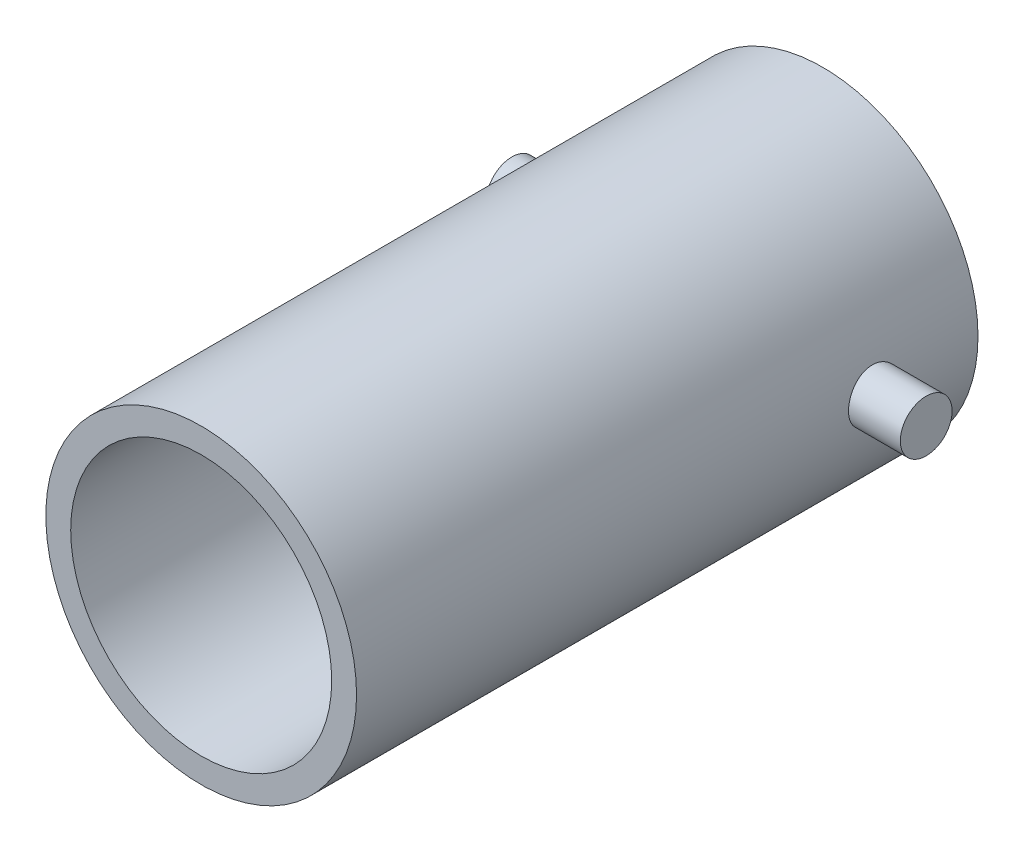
ISO-10303-21;
HEADER;
FILE_DESCRIPTION(('STEP AP214'),'2;1');
FILE_NAME('part.step','',(''),(''),'','','');
FILE_SCHEMA(('AUTOMOTIVE_DESIGN { 1 0 10303 214 1 1 1 1 }'));
ENDSEC;
DATA;
#1=APPLICATION_CONTEXT('core data for automotive mechanical design processes');
#2=APPLICATION_PROTOCOL_DEFINITION('international standard','automotive_design',2000,#1);
#3=PRODUCT_CONTEXT('',#1,'mechanical');
#4=PRODUCT('Part','Part','',(#3));
#5=PRODUCT_RELATED_PRODUCT_CATEGORY('part','',(#4));
#6=PRODUCT_DEFINITION_FORMATION('','',#4);
#7=PRODUCT_DEFINITION_CONTEXT('part definition',#1,'design');
#8=PRODUCT_DEFINITION('design','',#6,#7);
#9=PRODUCT_DEFINITION_SHAPE('','',#8);
#10=(LENGTH_UNIT() NAMED_UNIT(*) SI_UNIT(.MILLI.,.METRE.));
#11=(NAMED_UNIT(*) PLANE_ANGLE_UNIT() SI_UNIT($,.RADIAN.));
#12=(NAMED_UNIT(*) SI_UNIT($,.STERADIAN.) SOLID_ANGLE_UNIT());
#13=UNCERTAINTY_MEASURE_WITH_UNIT(LENGTH_MEASURE(1.E-05),#10,'distance_accuracy_value','');
#14=(GEOMETRIC_REPRESENTATION_CONTEXT(3) GLOBAL_UNCERTAINTY_ASSIGNED_CONTEXT((#13)) GLOBAL_UNIT_ASSIGNED_CONTEXT((#10,
#11,#12)) REPRESENTATION_CONTEXT('',''));
#15=CARTESIAN_POINT('',(0.,0.,0.));
#16=DIRECTION('',(0.,0.,1.));
#17=DIRECTION('',(1.,0.,0.));
#18=AXIS2_PLACEMENT_3D('',#15,#16,#17);
#19=CARTESIAN_POINT('',(0.,15.0876,-57.15));
#20=DIRECTION('',(0.,0.,1.));
#21=DIRECTION('',(1.,0.,0.));
#22=AXIS2_PLACEMENT_3D('',#19,#20,#21);
#23=CYLINDRICAL_SURFACE('',#22,4.7625);
#24=CARTESIAN_POINT('',(-4.7625,15.0876,-59.53125));
#25=CARTESIAN_POINT('',(-4.76249924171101,15.1318566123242,-59.5312517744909));
#26=CARTESIAN_POINT('',(-4.76187667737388,15.1761373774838,-59.5349638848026));
#27=CARTESIAN_POINT('',(-4.7594530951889,15.2634569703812,-59.549708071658));
#28=CARTESIAN_POINT('',(-4.75765099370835,15.3064946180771,-59.5607468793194));
#29=CARTESIAN_POINT('',(-4.75307046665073,15.39005200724,-59.5898019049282));
#30=CARTESIAN_POINT('',(-4.75029283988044,15.4305737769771,-59.6078124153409));
#31=CARTESIAN_POINT('',(-4.74406667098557,15.508015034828,-59.6502846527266));
#32=CARTESIAN_POINT('',(-4.74061820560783,15.5449349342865,-59.6747456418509));
#33=CARTESIAN_POINT('',(-4.73339578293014,15.6144825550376,-59.729673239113));
#34=CARTESIAN_POINT('',(-4.72961929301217,15.6470708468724,-59.760189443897));
#35=CARTESIAN_POINT('',(-4.72218584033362,15.7066895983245,-59.8262544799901));
#36=CARTESIAN_POINT('',(-4.71852888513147,15.7337197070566,-59.8618036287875));
#37=CARTESIAN_POINT('',(-4.7117240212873,15.7816128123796,-59.9371962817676));
#38=CARTESIAN_POINT('',(-4.70857938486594,15.8024368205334,-59.9770648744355));
#39=CARTESIAN_POINT('',(-4.70319033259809,15.8370772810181,-60.0597952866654));
#40=CARTESIAN_POINT('',(-4.70094585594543,15.8508942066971,-60.1026569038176));
#41=CARTESIAN_POINT('',(-4.69763645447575,15.8710040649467,-60.1897387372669));
#42=CARTESIAN_POINT('',(-4.6965608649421,15.8773650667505,-60.2339428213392));
#43=CARTESIAN_POINT('',(-4.69567875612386,15.8825935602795,-60.3228029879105));
#44=CARTESIAN_POINT('',(-4.69587214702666,15.8814615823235,-60.3674590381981));
#45=CARTESIAN_POINT('',(-4.69749641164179,15.8717916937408,-60.455469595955));
#46=CARTESIAN_POINT('',(-4.69891450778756,15.86333025,-60.4988327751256));
#47=CARTESIAN_POINT('',(-4.70280839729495,15.8393616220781,-60.5835152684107));
#48=CARTESIAN_POINT('',(-4.70528422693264,15.8238541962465,-60.6248345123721));
#49=CARTESIAN_POINT('',(-4.71102842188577,15.7861562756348,-60.7044851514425));
#50=CARTESIAN_POINT('',(-4.71430053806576,15.7639340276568,-60.7428012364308));
#51=CARTESIAN_POINT('',(-4.72126601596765,15.7134598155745,-60.8151896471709));
#52=CARTESIAN_POINT('',(-4.72495941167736,15.6852073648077,-60.8492616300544));
#53=CARTESIAN_POINT('',(-4.73240743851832,15.6230581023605,-60.9126372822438));
#54=CARTESIAN_POINT('',(-4.73616226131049,15.5890956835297,-60.9418766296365));
#55=CARTESIAN_POINT('',(-4.7432677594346,15.5167124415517,-60.9942511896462));
#56=CARTESIAN_POINT('',(-4.74661843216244,15.4782915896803,-61.0173863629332));
#57=CARTESIAN_POINT('',(-4.75254285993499,15.3980216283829,-61.0569017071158));
#58=CARTESIAN_POINT('',(-4.75511596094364,15.3561696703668,-61.0732761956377));
#59=CARTESIAN_POINT('',(-4.75919007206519,15.2702572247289,-61.0987456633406));
#60=CARTESIAN_POINT('',(-4.76069117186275,15.2261969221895,-61.1078412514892));
#61=CARTESIAN_POINT('',(-4.76244008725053,15.1376728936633,-61.1184075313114));
#62=CARTESIAN_POINT('',(-4.76270241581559,15.0932199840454,-61.1199665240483));
#63=CARTESIAN_POINT('',(-4.76198398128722,15.0046881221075,-61.1156507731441));
#64=CARTESIAN_POINT('',(-4.76100326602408,14.9606091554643,-61.10977631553));
#65=CARTESIAN_POINT('',(-4.75791792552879,14.8743491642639,-61.090833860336));
#66=CARTESIAN_POINT('',(-4.75582013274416,14.8321582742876,-61.0778095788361));
#67=CARTESIAN_POINT('',(-4.75073492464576,14.7505588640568,-61.0449837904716));
#68=CARTESIAN_POINT('',(-4.74774745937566,14.7111505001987,-61.0251819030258));
#69=CARTESIAN_POINT('',(-4.74117833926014,14.6358512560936,-60.9791607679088));
#70=CARTESIAN_POINT('',(-4.73759166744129,14.5999945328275,-60.9528863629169));
#71=CARTESIAN_POINT('',(-4.73023713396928,14.5331676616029,-60.8947419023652));
#72=CARTESIAN_POINT('',(-4.72646925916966,14.5021978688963,-60.8628714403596));
#73=CARTESIAN_POINT('',(-4.71913005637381,14.4456966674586,-60.7940435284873));
#74=CARTESIAN_POINT('',(-4.71556116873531,14.4202249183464,-60.7570368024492));
#75=CARTESIAN_POINT('',(-4.70906960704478,14.3758595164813,-60.6792179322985));
#76=CARTESIAN_POINT('',(-4.70614691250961,14.3569656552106,-60.6384059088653));
#77=CARTESIAN_POINT('',(-4.70129696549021,14.3263815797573,-60.5543017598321));
#78=CARTESIAN_POINT('',(-4.69936561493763,14.314661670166,-60.5110206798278));
#79=CARTESIAN_POINT('',(-4.69670675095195,14.2986647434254,-60.4230693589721));
#80=CARTESIAN_POINT('',(-4.69597913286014,14.2943870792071,-60.3783992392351));
#81=CARTESIAN_POINT('',(-4.69581462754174,14.29341411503,-60.2895336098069));
#82=CARTESIAN_POINT('',(-4.69636175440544,14.2966249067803,-60.2453391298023));
#83=CARTESIAN_POINT('',(-4.69865005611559,14.3103346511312,-60.1581285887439));
#84=CARTESIAN_POINT('',(-4.70039122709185,14.3208335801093,-60.115112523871));
#85=CARTESIAN_POINT('',(-4.70486535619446,14.3487855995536,-60.0315161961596));
#86=CARTESIAN_POINT('',(-4.70759716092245,14.3662306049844,-59.9909331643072));
#87=CARTESIAN_POINT('',(-4.71374587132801,14.4075699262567,-59.9132546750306));
#88=CARTESIAN_POINT('',(-4.71716281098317,14.4314645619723,-59.8761593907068));
#89=CARTESIAN_POINT('',(-4.72434746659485,14.4853600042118,-59.8060349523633));
#90=CARTESIAN_POINT('',(-4.72811886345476,14.515429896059,-59.7730592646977));
#91=CARTESIAN_POINT('',(-4.73555813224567,14.5806766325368,-59.7125896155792));
#92=CARTESIAN_POINT('',(-4.73922598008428,14.6158546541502,-59.6850969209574));
#93=CARTESIAN_POINT('',(-4.74607423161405,14.6906077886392,-59.6362001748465));
#94=CARTESIAN_POINT('',(-4.74925109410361,14.7302115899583,-59.6148394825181));
#95=CARTESIAN_POINT('',(-4.75472495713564,14.8124821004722,-59.5791069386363));
#96=CARTESIAN_POINT('',(-4.7570228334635,14.8551457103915,-59.5647281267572));
#97=CARTESIAN_POINT('',(-4.75997838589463,14.9295791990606,-59.5464883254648));
#98=CARTESIAN_POINT('',(-4.76091893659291,14.9608988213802,-59.5407831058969));
#99=CARTESIAN_POINT('',(-4.76218001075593,15.0240081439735,-59.5331633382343));
#100=CARTESIAN_POINT('',(-4.76250054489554,15.0557978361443,-59.5312487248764));
#101=CARTESIAN_POINT('',(-4.7625,15.0876,-59.53125));
#102=B_SPLINE_CURVE_WITH_KNOTS('',3,(#24,#25,#26,#27,#28,#29,#30,#31,#32,#33,#34,#35,#36,#37,
#38,#39,#40,#41,#42,#43,#44,#45,#46,#47,#48,#49,#50,#51,#52,#53,#54,#55,#56,#57,#58,#59,#60,#61,
#62,#63,#64,#65,#66,#67,#68,#69,#70,#71,#72,#73,#74,#75,#76,#77,#78,#79,#80,#81,#82,#83,#84,#85,
#86,#87,#88,#89,#90,#91,#92,#93,#94,#95,#96,#97,#98,#99,#100,#101),.UNSPECIFIED.,.T.,.F.,(4,2,2,
2,2,2,2,2,2,2,2,2,2,2,2,2,2,2,2,2,2,2,2,2,2,2,2,2,2,2,2,2,2,2,2,2,2,2,4),(0.,0.132653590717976,
0.265429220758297,0.398096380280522,0.530748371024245,0.664535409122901,0.798330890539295,
0.932950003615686,1.06756002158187,1.20093129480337,1.33429312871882,1.4662801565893,
1.59827171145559,1.73089746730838,1.86353393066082,1.99781404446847,2.13209502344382,
2.266488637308,2.40087100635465,2.53367503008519,2.66647394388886,2.79846978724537,
2.93047304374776,3.0636426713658,3.19682197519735,3.33138088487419,3.46593552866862,
3.59992937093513,3.73391156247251,3.86622261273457,3.99853323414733,4.13069029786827,
4.26285391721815,4.39658564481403,4.53034823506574,4.66503458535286,4.79958638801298,
4.89491098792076,4.99023394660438),.UNSPECIFIED.);
#103=CARTESIAN_POINT('',(-4.7625,15.0876,-59.53125));
#104=VERTEX_POINT('',#103);
#105=EDGE_CURVE('E50',#104,#104,#102,.T.);
#106=ORIENTED_EDGE('',*,*,#105,.F.);
#107=EDGE_LOOP('',(#106));
#108=FACE_BOUND('',#107,.T.);
#109=CARTESIAN_POINT('',(0.,15.0876,-44.45));
#110=DIRECTION('',(0.,0.,1.));
#111=DIRECTION('',(1.,0.,0.));
#112=AXIS2_PLACEMENT_3D('',#109,#110,#111);
#113=CIRCLE('',#112,4.7625);
#114=CARTESIAN_POINT('',(4.7625,15.0876,-44.45));
#115=VERTEX_POINT('',#114);
#116=EDGE_CURVE('E57',#115,#115,#113,.F.);
#117=ORIENTED_EDGE('',*,*,#116,.T.);
#118=EDGE_LOOP('',(#117));
#119=FACE_BOUND('',#118,.T.);
#120=CARTESIAN_POINT('',(0.,15.0876,-63.5));
#121=DIRECTION('',(0.,0.,-1.));
#122=DIRECTION('',(-1.,0.,0.));
#123=AXIS2_PLACEMENT_3D('',#120,#121,#122);
#124=CIRCLE('',#123,4.7625);
#125=CARTESIAN_POINT('',(-4.7625,15.0876,-63.5));
#126=VERTEX_POINT('',#125);
#127=EDGE_CURVE('E51',#126,#126,#124,.T.);
#128=ORIENTED_EDGE('',*,*,#127,.F.);
#129=EDGE_LOOP('',(#128));
#130=FACE_BOUND('',#129,.T.);
#131=CARTESIAN_POINT('',(4.7625,15.0876,-61.11875));
#132=CARTESIAN_POINT('',(4.76249924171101,15.1318566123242,-61.1187482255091));
#133=CARTESIAN_POINT('',(4.76187667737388,15.1761373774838,-61.1150361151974));
#134=CARTESIAN_POINT('',(4.7594530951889,15.2634569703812,-61.100291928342));
#135=CARTESIAN_POINT('',(4.75765099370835,15.3064946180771,-61.0892531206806));
#136=CARTESIAN_POINT('',(4.75307046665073,15.39005200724,-61.0601980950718));
#137=CARTESIAN_POINT('',(4.75029283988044,15.4305737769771,-61.0421875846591));
#138=CARTESIAN_POINT('',(4.74406667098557,15.508015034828,-60.9997153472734));
#139=CARTESIAN_POINT('',(4.74061820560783,15.5449349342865,-60.9752543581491));
#140=CARTESIAN_POINT('',(4.73339578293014,15.6144825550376,-60.920326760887));
#141=CARTESIAN_POINT('',(4.72961929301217,15.6470708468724,-60.889810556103));
#142=CARTESIAN_POINT('',(4.72218584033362,15.7066895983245,-60.8237455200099));
#143=CARTESIAN_POINT('',(4.71852888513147,15.7337197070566,-60.7881963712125));
#144=CARTESIAN_POINT('',(4.7117240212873,15.7816128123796,-60.7128037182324));
#145=CARTESIAN_POINT('',(4.70857938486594,15.8024368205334,-60.6729351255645));
#146=CARTESIAN_POINT('',(4.70319033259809,15.8370772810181,-60.5902047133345));
#147=CARTESIAN_POINT('',(4.70094585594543,15.8508942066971,-60.5473430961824));
#148=CARTESIAN_POINT('',(4.69763645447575,15.8710040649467,-60.460261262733));
#149=CARTESIAN_POINT('',(4.6965608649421,15.8773650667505,-60.4160571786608));
#150=CARTESIAN_POINT('',(4.69567875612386,15.8825935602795,-60.3271970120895));
#151=CARTESIAN_POINT('',(4.69587214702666,15.8814615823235,-60.2825409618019));
#152=CARTESIAN_POINT('',(4.69749641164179,15.8717916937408,-60.194530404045));
#153=CARTESIAN_POINT('',(4.69891450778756,15.86333025,-60.1511672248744));
#154=CARTESIAN_POINT('',(4.70280839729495,15.8393616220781,-60.0664847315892));
#155=CARTESIAN_POINT('',(4.70528422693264,15.8238541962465,-60.0251654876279));
#156=CARTESIAN_POINT('',(4.71102842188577,15.7861562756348,-59.9455148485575));
#157=CARTESIAN_POINT('',(4.71430053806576,15.7639340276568,-59.9071987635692));
#158=CARTESIAN_POINT('',(4.72126601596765,15.7134598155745,-59.8348103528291));
#159=CARTESIAN_POINT('',(4.72495941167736,15.6852073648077,-59.8007383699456));
#160=CARTESIAN_POINT('',(4.73240743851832,15.6230581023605,-59.7373627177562));
#161=CARTESIAN_POINT('',(4.73616226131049,15.5890956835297,-59.7081233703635));
#162=CARTESIAN_POINT('',(4.7432677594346,15.5167124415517,-59.6557488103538));
#163=CARTESIAN_POINT('',(4.74661843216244,15.4782915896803,-59.6326136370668));
#164=CARTESIAN_POINT('',(4.75254285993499,15.3980216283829,-59.5930982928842));
#165=CARTESIAN_POINT('',(4.75511596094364,15.3561696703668,-59.5767238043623));
#166=CARTESIAN_POINT('',(4.75919007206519,15.2702572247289,-59.5512543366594));
#167=CARTESIAN_POINT('',(4.76069117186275,15.2261969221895,-59.5421587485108));
#168=CARTESIAN_POINT('',(4.76244008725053,15.1376728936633,-59.5315924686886));
#169=CARTESIAN_POINT('',(4.76270241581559,15.0932199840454,-59.5300334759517));
#170=CARTESIAN_POINT('',(4.76198398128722,15.0046881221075,-59.5343492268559));
#171=CARTESIAN_POINT('',(4.76100326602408,14.9606091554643,-59.54022368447));
#172=CARTESIAN_POINT('',(4.75791792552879,14.8743491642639,-59.559166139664));
#173=CARTESIAN_POINT('',(4.75582013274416,14.8321582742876,-59.5721904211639));
#174=CARTESIAN_POINT('',(4.75073492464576,14.7505588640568,-59.6050162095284));
#175=CARTESIAN_POINT('',(4.74774745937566,14.7111505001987,-59.6248180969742));
#176=CARTESIAN_POINT('',(4.74117833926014,14.6358512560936,-59.6708392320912));
#177=CARTESIAN_POINT('',(4.73759166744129,14.5999945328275,-59.6971136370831));
#178=CARTESIAN_POINT('',(4.73023713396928,14.5331676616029,-59.7552580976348));
#179=CARTESIAN_POINT('',(4.72646925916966,14.5021978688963,-59.7871285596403));
#180=CARTESIAN_POINT('',(4.71913005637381,14.4456966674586,-59.8559564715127));
#181=CARTESIAN_POINT('',(4.71556116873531,14.4202249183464,-59.8929631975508));
#182=CARTESIAN_POINT('',(4.70906960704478,14.3758595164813,-59.9707820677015));
#183=CARTESIAN_POINT('',(4.70614691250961,14.3569656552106,-60.0115940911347));
#184=CARTESIAN_POINT('',(4.70129696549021,14.3263815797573,-60.0956982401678));
#185=CARTESIAN_POINT('',(4.69936561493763,14.314661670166,-60.1389793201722));
#186=CARTESIAN_POINT('',(4.69670675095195,14.2986647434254,-60.2269306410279));
#187=CARTESIAN_POINT('',(4.69597913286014,14.2943870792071,-60.2716007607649));
#188=CARTESIAN_POINT('',(4.69581462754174,14.29341411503,-60.3604663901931));
#189=CARTESIAN_POINT('',(4.69636175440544,14.2966249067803,-60.4046608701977));
#190=CARTESIAN_POINT('',(4.69865005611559,14.3103346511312,-60.4918714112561));
#191=CARTESIAN_POINT('',(4.70039122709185,14.3208335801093,-60.5348874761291));
#192=CARTESIAN_POINT('',(4.70486535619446,14.3487855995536,-60.6184838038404));
#193=CARTESIAN_POINT('',(4.70759716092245,14.3662306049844,-60.6590668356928));
#194=CARTESIAN_POINT('',(4.71374587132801,14.4075699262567,-60.7367453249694));
#195=CARTESIAN_POINT('',(4.71716281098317,14.4314645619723,-60.7738406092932));
#196=CARTESIAN_POINT('',(4.72434746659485,14.4853600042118,-60.8439650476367));
#197=CARTESIAN_POINT('',(4.72811886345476,14.515429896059,-60.8769407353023));
#198=CARTESIAN_POINT('',(4.73555813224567,14.5806766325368,-60.9374103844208));
#199=CARTESIAN_POINT('',(4.73922598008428,14.6158546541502,-60.9649030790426));
#200=CARTESIAN_POINT('',(4.74607423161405,14.6906077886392,-61.0137998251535));
#201=CARTESIAN_POINT('',(4.74925109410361,14.7302115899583,-61.0351605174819));
#202=CARTESIAN_POINT('',(4.75472495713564,14.8124821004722,-61.0708930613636));
#203=CARTESIAN_POINT('',(4.7570228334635,14.8551457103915,-61.0852718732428));
#204=CARTESIAN_POINT('',(4.75997838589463,14.9295791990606,-61.1035116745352));
#205=CARTESIAN_POINT('',(4.76091893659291,14.9608988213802,-61.1092168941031));
#206=CARTESIAN_POINT('',(4.76218001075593,15.0240081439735,-61.1168366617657));
#207=CARTESIAN_POINT('',(4.76250054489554,15.0557978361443,-61.1187512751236));
#208=CARTESIAN_POINT('',(4.7625,15.0876,-61.11875));
#209=B_SPLINE_CURVE_WITH_KNOTS('',3,(#131,#132,#133,#134,#135,#136,#137,#138,#139,#140,#141,
#142,#143,#144,#145,#146,#147,#148,#149,#150,#151,#152,#153,#154,#155,#156,#157,#158,#159,#160,
#161,#162,#163,#164,#165,#166,#167,#168,#169,#170,#171,#172,#173,#174,#175,#176,#177,#178,#179,
#180,#181,#182,#183,#184,#185,#186,#187,#188,#189,#190,#191,#192,#193,#194,#195,#196,#197,#198,
#199,#200,#201,#202,#203,#204,#205,#206,#207,#208),.UNSPECIFIED.,.T.,.F.,(4,2,2,2,2,2,2,2,2,2,2,
2,2,2,2,2,2,2,2,2,2,2,2,2,2,2,2,2,2,2,2,2,2,2,2,2,2,2,4),(0.,0.132653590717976,
0.265429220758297,0.398096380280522,0.530748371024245,0.664535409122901,0.798330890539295,
0.932950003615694,1.06756002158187,1.20093129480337,1.33429312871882,1.46628015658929,
1.59827171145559,1.73089746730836,1.86353393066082,1.99781404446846,2.13209502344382,
2.266488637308,2.40087100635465,2.53367503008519,2.66647394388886,2.79846978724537,
2.93047304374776,3.0636426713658,3.19682197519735,3.33138088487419,3.46593552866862,
3.59992937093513,3.73391156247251,3.86622261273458,3.99853323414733,4.13069029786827,
4.26285391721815,4.39658564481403,4.53034823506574,4.66503458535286,4.79958638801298,
4.89491098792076,4.99023394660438),.UNSPECIFIED.);
#210=CARTESIAN_POINT('',(4.7625,15.0876,-61.11875));
#211=VERTEX_POINT('',#210);
#212=EDGE_CURVE('E54',#211,#211,#209,.T.);
#213=ORIENTED_EDGE('',*,*,#212,.F.);
#214=EDGE_LOOP('',(#213));
#215=FACE_BOUND('',#214,.T.);
#216=ADVANCED_FACE('F34',(#108,#119,#130,#215),#23,.T.);
#217=CARTESIAN_POINT('',(0.,15.0876,-63.5));
#218=DIRECTION('',(0.,0.,-1.));
#219=DIRECTION('',(-1.,0.,0.));
#220=AXIS2_PLACEMENT_3D('',#217,#218,#219);
#221=PLANE('',#220);
#222=CARTESIAN_POINT('',(0.,15.0876,-63.5));
#223=DIRECTION('',(0.,0.,-1.));
#224=DIRECTION('',(-1.,0.,0.));
#225=AXIS2_PLACEMENT_3D('',#222,#223,#224);
#226=CIRCLE('',#225,4.0005);
#227=CARTESIAN_POINT('',(-4.0005,15.0876,-63.5));
#228=VERTEX_POINT('',#227);
#229=EDGE_CURVE('E38',#228,#228,#226,.T.);
#230=ORIENTED_EDGE('',*,*,#229,.F.);
#231=EDGE_LOOP('',(#230));
#232=FACE_BOUND('',#231,.T.);
#233=ORIENTED_EDGE('',*,*,#127,.T.);
#234=EDGE_LOOP('',(#233));
#235=FACE_BOUND('',#234,.T.);
#236=ADVANCED_FACE('F77',(#232,#235),#221,.T.);
#237=CARTESIAN_POINT('',(-6.35,15.0876,-60.325));
#238=DIRECTION('',(1.,0.,0.));
#239=DIRECTION('',(0.,0.,-1.));
#240=AXIS2_PLACEMENT_3D('',#237,#238,#239);
#241=PLANE('',#240);
#242=CARTESIAN_POINT('',(-6.35,15.0876,-60.325));
#243=DIRECTION('',(1.,0.,0.));
#244=DIRECTION('',(0.,0.,-1.));
#245=AXIS2_PLACEMENT_3D('',#242,#243,#244);
#246=CIRCLE('',#245,0.79375);
#247=CARTESIAN_POINT('',(-6.35,15.0876,-61.11875));
#248=VERTEX_POINT('',#247);
#249=EDGE_CURVE('E47',#248,#248,#246,.T.);
#250=ORIENTED_EDGE('',*,*,#249,.F.);
#251=EDGE_LOOP('',(#250));
#252=FACE_BOUND('',#251,.T.);
#253=ADVANCED_FACE('F83',(#252),#241,.F.);
#254=CARTESIAN_POINT('',(6.35,15.0876,-60.325));
#255=DIRECTION('',(-1.,0.,0.));
#256=DIRECTION('',(0.,0.,1.));
#257=AXIS2_PLACEMENT_3D('',#254,#255,#256);
#258=CYLINDRICAL_SURFACE('',#257,0.79375);
#259=ORIENTED_EDGE('',*,*,#249,.T.);
#260=EDGE_LOOP('',(#259));
#261=FACE_BOUND('',#260,.T.);
#262=ORIENTED_EDGE('',*,*,#105,.T.);
#263=EDGE_LOOP('',(#262));
#264=FACE_BOUND('',#263,.T.);
#265=ADVANCED_FACE('F75',(#261,#264),#258,.T.);
#266=CARTESIAN_POINT('',(6.35,15.0876,-60.325));
#267=DIRECTION('',(1.,0.,0.));
#268=DIRECTION('',(0.,0.,-1.));
#269=AXIS2_PLACEMENT_3D('',#266,#267,#268);
#270=CIRCLE('',#269,0.79375);
#271=CARTESIAN_POINT('',(6.35,15.0876,-61.11875));
#272=VERTEX_POINT('',#271);
#273=EDGE_CURVE('E45',#272,#272,#270,.T.);
#274=ORIENTED_EDGE('',*,*,#273,.F.);
#275=EDGE_LOOP('',(#274));
#276=FACE_BOUND('',#275,.T.);
#277=ORIENTED_EDGE('',*,*,#212,.T.);
#278=EDGE_LOOP('',(#277));
#279=FACE_BOUND('',#278,.T.);
#280=ADVANCED_FACE('F70',(#276,#279),#258,.T.);
#281=CARTESIAN_POINT('',(6.35,15.0876,-60.325));
#282=DIRECTION('',(1.,0.,0.));
#283=DIRECTION('',(0.,0.,-1.));
#284=AXIS2_PLACEMENT_3D('',#281,#282,#283);
#285=PLANE('',#284);
#286=ORIENTED_EDGE('',*,*,#273,.T.);
#287=EDGE_LOOP('',(#286));
#288=FACE_BOUND('',#287,.T.);
#289=ADVANCED_FACE('F74',(#288),#285,.T.);
#290=CARTESIAN_POINT('',(0.,15.0876,-44.45));
#291=DIRECTION('',(0.,0.,-1.));
#292=DIRECTION('',(-1.,0.,0.));
#293=AXIS2_PLACEMENT_3D('',#290,#291,#292);
#294=CYLINDRICAL_SURFACE('',#293,4.0005);
#295=CARTESIAN_POINT('',(0.,15.0876,-44.45));
#296=DIRECTION('',(0.,0.,-1.));
#297=DIRECTION('',(-1.,0.,0.));
#298=AXIS2_PLACEMENT_3D('',#295,#296,#297);
#299=CIRCLE('',#298,4.0005);
#300=CARTESIAN_POINT('',(-4.0005,15.0876,-44.45));
#301=VERTEX_POINT('',#300);
#302=EDGE_CURVE('E10',#301,#301,#299,.T.);
#303=CARTESIAN_POINT('',(-4.0005,15.0876,-44.45));
#304=CARTESIAN_POINT('',(-4.0005,15.0876,-44.6484375));
#305=CARTESIAN_POINT('',(-4.0005,15.0876,-44.846875));
#306=CARTESIAN_POINT('',(-4.0005,15.0876,-45.24375));
#307=CARTESIAN_POINT('',(-4.0005,15.0876,-45.4421875));
#308=CARTESIAN_POINT('',(-4.0005,15.0876,-45.8390625));
#309=CARTESIAN_POINT('',(-4.0005,15.0876,-46.0375));
#310=CARTESIAN_POINT('',(-4.0005,15.0876,-46.434375));
#311=CARTESIAN_POINT('',(-4.0005,15.0876,-46.6328125));
#312=CARTESIAN_POINT('',(-4.0005,15.0876,-47.0296875));
#313=CARTESIAN_POINT('',(-4.0005,15.0876,-47.228125));
#314=CARTESIAN_POINT('',(-4.0005,15.0876,-47.625));
#315=CARTESIAN_POINT('',(-4.0005,15.0876,-47.8234375));
#316=CARTESIAN_POINT('',(-4.0005,15.0876,-48.2203125));
#317=CARTESIAN_POINT('',(-4.0005,15.0876,-48.41875));
#318=CARTESIAN_POINT('',(-4.0005,15.0876,-48.815625));
#319=CARTESIAN_POINT('',(-4.0005,15.0876,-49.0140625));
#320=CARTESIAN_POINT('',(-4.0005,15.0876,-49.4109375));
#321=CARTESIAN_POINT('',(-4.0005,15.0876,-49.609375));
#322=CARTESIAN_POINT('',(-4.0005,15.0876,-50.00625));
#323=CARTESIAN_POINT('',(-4.0005,15.0876,-50.2046875));
#324=CARTESIAN_POINT('',(-4.0005,15.0876,-50.6015625));
#325=CARTESIAN_POINT('',(-4.0005,15.0876,-50.8));
#326=CARTESIAN_POINT('',(-4.0005,15.0876,-51.196875));
#327=CARTESIAN_POINT('',(-4.0005,15.0876,-51.3953125));
#328=CARTESIAN_POINT('',(-4.0005,15.0876,-51.7921875));
#329=CARTESIAN_POINT('',(-4.0005,15.0876,-51.990625));
#330=CARTESIAN_POINT('',(-4.0005,15.0876,-52.3875));
#331=CARTESIAN_POINT('',(-4.0005,15.0876,-52.5859375));
#332=CARTESIAN_POINT('',(-4.0005,15.0876,-52.9828125));
#333=CARTESIAN_POINT('',(-4.0005,15.0876,-53.18125));
#334=CARTESIAN_POINT('',(-4.0005,15.0876,-53.578125));
#335=CARTESIAN_POINT('',(-4.0005,15.0876,-53.7765625));
#336=CARTESIAN_POINT('',(-4.0005,15.0876,-54.1734375));
#337=CARTESIAN_POINT('',(-4.0005,15.0876,-54.371875));
#338=CARTESIAN_POINT('',(-4.0005,15.0876,-54.76875));
#339=CARTESIAN_POINT('',(-4.0005,15.0876,-54.9671875));
#340=CARTESIAN_POINT('',(-4.0005,15.0876,-55.3640625));
#341=CARTESIAN_POINT('',(-4.0005,15.0876,-55.5625));
#342=CARTESIAN_POINT('',(-4.0005,15.0876,-55.959375));
#343=CARTESIAN_POINT('',(-4.0005,15.0876,-56.1578125));
#344=CARTESIAN_POINT('',(-4.0005,15.0876,-56.5546875));
#345=CARTESIAN_POINT('',(-4.0005,15.0876,-56.753125));
#346=CARTESIAN_POINT('',(-4.0005,15.0876,-57.15));
#347=CARTESIAN_POINT('',(-4.0005,15.0876,-57.3484375));
#348=CARTESIAN_POINT('',(-4.0005,15.0876,-57.7453125));
#349=CARTESIAN_POINT('',(-4.0005,15.0876,-57.94375));
#350=CARTESIAN_POINT('',(-4.0005,15.0876,-58.340625));
#351=CARTESIAN_POINT('',(-4.0005,15.0876,-58.5390625));
#352=CARTESIAN_POINT('',(-4.0005,15.0876,-58.9359375));
#353=CARTESIAN_POINT('',(-4.0005,15.0876,-59.134375));
#354=CARTESIAN_POINT('',(-4.0005,15.0876,-59.53125));
#355=CARTESIAN_POINT('',(-4.0005,15.0876,-59.7296875));
#356=CARTESIAN_POINT('',(-4.0005,15.0876,-60.1265625));
#357=CARTESIAN_POINT('',(-4.0005,15.0876,-60.325));
#358=CARTESIAN_POINT('',(-4.0005,15.0876,-60.721875));
#359=CARTESIAN_POINT('',(-4.0005,15.0876,-60.9203125));
#360=CARTESIAN_POINT('',(-4.0005,15.0876,-61.3171875));
#361=CARTESIAN_POINT('',(-4.0005,15.0876,-61.515625));
#362=CARTESIAN_POINT('',(-4.0005,15.0876,-61.9125));
#363=CARTESIAN_POINT('',(-4.0005,15.0876,-62.1109375));
#364=CARTESIAN_POINT('',(-4.0005,15.0876,-62.5078125));
#365=CARTESIAN_POINT('',(-4.0005,15.0876,-62.70625));
#366=CARTESIAN_POINT('',(-4.0005,15.0876,-63.103125));
#367=CARTESIAN_POINT('',(-4.0005,15.0876,-63.3015625));
#368=CARTESIAN_POINT('',(-4.0005,15.0876,-63.5));
#369=B_SPLINE_CURVE_WITH_KNOTS('',3,(#303,#304,#305,#306,#307,#308,#309,#310,#311,#312,#313,
#314,#315,#316,#317,#318,#319,#320,#321,#322,#323,#324,#325,#326,#327,#328,#329,#330,#331,#332,
#333,#334,#335,#336,#337,#338,#339,#340,#341,#342,#343,#344,#345,#346,#347,#348,#349,#350,#351,
#352,#353,#354,#355,#356,#357,#358,#359,#360,#361,#362,#363,#364,#365,#366,#367,#368),
.UNSPECIFIED.,.F.,.F.,(4,2,2,2,2,2,2,2,2,2,2,2,2,2,2,2,2,2,2,2,2,2,2,2,2,2,2,2,2,2,2,2,4),(0.,
0.5953125,1.190625,1.7859375,2.38125,2.9765625,3.571875,4.1671875,4.7625,5.3578125,5.953125,
6.5484375,7.14375,7.7390625,8.334375,8.9296875,9.525,10.1203125,10.715625,11.3109375,11.90625,
12.5015625,13.096875,13.6921875,14.2875,14.8828125,15.478125,16.0734375,16.66875,17.2640625,
17.859375,18.4546875,19.05),.UNSPECIFIED.);
#370=EDGE_CURVE('BSEAM81',#301,#228,#369,.T.);
#371=ORIENTED_EDGE('',*,*,#302,.F.);
#372=ORIENTED_EDGE('',*,*,#229,.T.);
#373=ORIENTED_EDGE('',*,*,#370,.T.);
#374=ORIENTED_EDGE('',*,*,#370,.F.);
#375=EDGE_LOOP('',(#371,#373,#372,#374));
#376=FACE_BOUND('',#375,.T.);
#377=ADVANCED_FACE('F81',(#376),#294,.F.);
#378=CARTESIAN_POINT('',(-30.7865983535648,147.339161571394,-44.45));
#379=DIRECTION('',(0.,0.,-1.));
#380=DIRECTION('',(-1.,0.,0.));
#381=AXIS2_PLACEMENT_3D('',#378,#379,#380);
#382=PLANE('',#381);
#383=ORIENTED_EDGE('',*,*,#302,.T.);
#384=EDGE_LOOP('',(#383));
#385=FACE_BOUND('',#384,.T.);
#386=ORIENTED_EDGE('',*,*,#116,.F.);
#387=EDGE_LOOP('',(#386));
#388=FACE_BOUND('',#387,.T.);
#389=ADVANCED_FACE('F36',(#385,#388),#382,.F.);
#390=CLOSED_SHELL('',(#216,#236,#253,#265,#280,#289,#377,#389));
#391=MANIFOLD_SOLID_BREP('B2',#390);
#392=ADVANCED_BREP_SHAPE_REPRESENTATION('',(#18,#391),#14);
#393=SHAPE_DEFINITION_REPRESENTATION(#9,#392);
ENDSEC;
END-ISO-10303-21;
